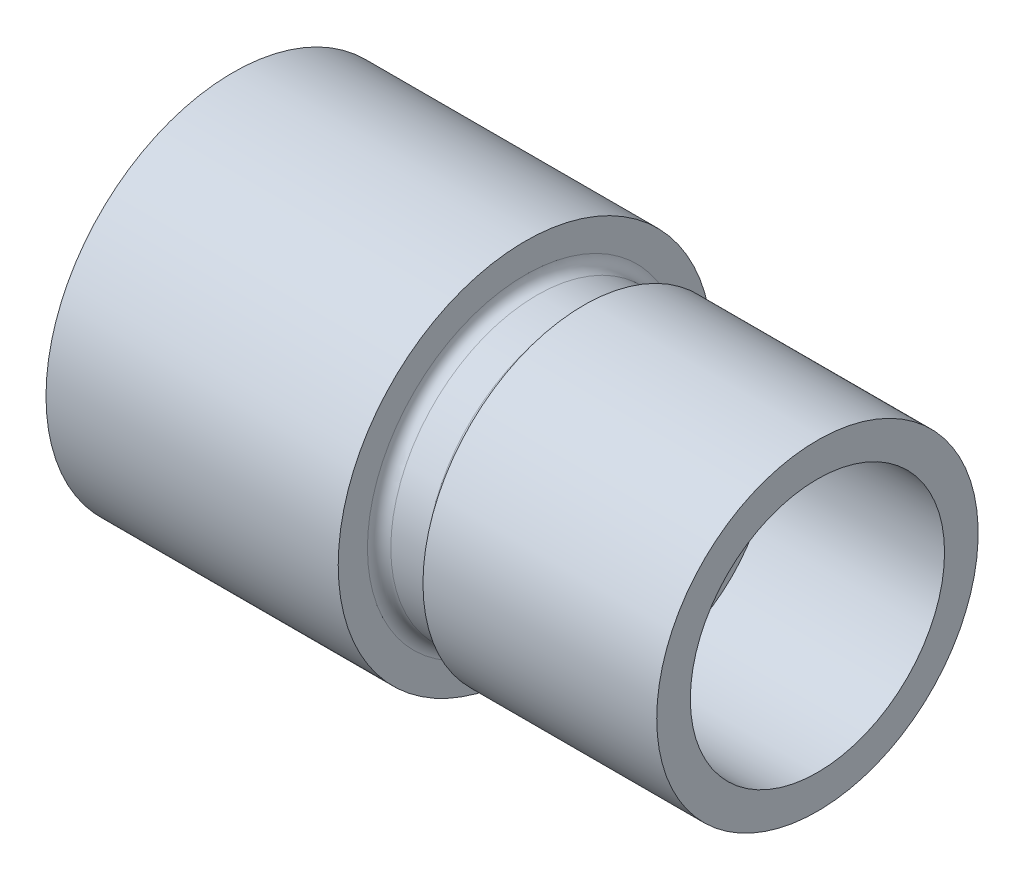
ISO-10303-21;
HEADER;
FILE_DESCRIPTION(('STEP AP214'),'2;1');
FILE_NAME('part.step','',(''),(''),'','','');
FILE_SCHEMA(('AUTOMOTIVE_DESIGN { 1 0 10303 214 1 1 1 1 }'));
ENDSEC;
DATA;
#1=APPLICATION_CONTEXT('core data for automotive mechanical design processes');
#2=APPLICATION_PROTOCOL_DEFINITION('international standard','automotive_design',2000,#1);
#3=PRODUCT_CONTEXT('',#1,'mechanical');
#4=PRODUCT('Part','Part','',(#3));
#5=PRODUCT_RELATED_PRODUCT_CATEGORY('part','',(#4));
#6=PRODUCT_DEFINITION_FORMATION('','',#4);
#7=PRODUCT_DEFINITION_CONTEXT('part definition',#1,'design');
#8=PRODUCT_DEFINITION('design','',#6,#7);
#9=PRODUCT_DEFINITION_SHAPE('','',#8);
#10=(LENGTH_UNIT() NAMED_UNIT(*) SI_UNIT(.MILLI.,.METRE.));
#11=(NAMED_UNIT(*) PLANE_ANGLE_UNIT() SI_UNIT($,.RADIAN.));
#12=(NAMED_UNIT(*) SI_UNIT($,.STERADIAN.) SOLID_ANGLE_UNIT());
#13=UNCERTAINTY_MEASURE_WITH_UNIT(LENGTH_MEASURE(1.E-05),#10,'distance_accuracy_value','');
#14=(GEOMETRIC_REPRESENTATION_CONTEXT(3) GLOBAL_UNCERTAINTY_ASSIGNED_CONTEXT((#13)) GLOBAL_UNIT_ASSIGNED_CONTEXT((#10,
#11,#12)) REPRESENTATION_CONTEXT('',''));
#15=CARTESIAN_POINT('',(0.,0.,0.));
#16=DIRECTION('',(0.,0.,1.));
#17=DIRECTION('',(1.,0.,0.));
#18=AXIS2_PLACEMENT_3D('',#15,#16,#17);
#19=CARTESIAN_POINT('',(0.,0.,0.));
#20=DIRECTION('',(-1.,0.,0.));
#21=DIRECTION('',(0.,0.,1.));
#22=AXIS2_PLACEMENT_3D('',#19,#20,#21);
#23=CYLINDRICAL_SURFACE('',#22,6.4);
#24=CARTESIAN_POINT('',(0.,0.,0.));
#25=DIRECTION('',(-1.,0.,0.));
#26=DIRECTION('',(0.,0.,1.));
#27=AXIS2_PLACEMENT_3D('',#24,#25,#26);
#28=CIRCLE('',#27,6.4);
#29=CARTESIAN_POINT('',(0.,0.,6.4));
#30=VERTEX_POINT('',#29);
#31=EDGE_CURVE('E12',#30,#30,#28,.T.);
#32=ORIENTED_EDGE('',*,*,#31,.F.);
#33=EDGE_LOOP('',(#32));
#34=FACE_BOUND('',#33,.T.);
#35=CARTESIAN_POINT('',(10.,0.,0.));
#36=DIRECTION('',(-1.,0.,0.));
#37=DIRECTION('',(0.,0.,1.));
#38=AXIS2_PLACEMENT_3D('',#35,#36,#37);
#39=CIRCLE('',#38,6.4);
#40=CARTESIAN_POINT('',(10.,0.,6.4));
#41=VERTEX_POINT('',#40);
#42=EDGE_CURVE('E89',#41,#41,#39,.T.);
#43=ORIENTED_EDGE('',*,*,#42,.T.);
#44=EDGE_LOOP('',(#43));
#45=FACE_BOUND('',#44,.T.);
#46=ADVANCED_FACE('F43',(#34,#45),#23,.T.);
#47=CARTESIAN_POINT('',(0.,6.4,0.));
#48=DIRECTION('',(1.,0.,0.));
#49=DIRECTION('',(0.,0.,-1.));
#50=AXIS2_PLACEMENT_3D('',#47,#48,#49);
#51=PLANE('',#50);
#52=CARTESIAN_POINT('',(0.,0.,0.));
#53=DIRECTION('',(-1.,0.,0.));
#54=DIRECTION('',(0.,0.,1.));
#55=AXIS2_PLACEMENT_3D('',#52,#53,#54);
#56=CIRCLE('',#55,4.325);
#57=CARTESIAN_POINT('',(0.,0.,4.325));
#58=VERTEX_POINT('',#57);
#59=EDGE_CURVE('E49',#58,#58,#56,.T.);
#60=ORIENTED_EDGE('',*,*,#59,.F.);
#61=EDGE_LOOP('',(#60));
#62=FACE_BOUND('',#61,.T.);
#63=ORIENTED_EDGE('',*,*,#31,.T.);
#64=EDGE_LOOP('',(#63));
#65=FACE_BOUND('',#64,.T.);
#66=ADVANCED_FACE('F162',(#62,#65),#51,.F.);
#67=CARTESIAN_POINT('',(0.,0.,0.));
#68=DIRECTION('',(-1.,0.,0.));
#69=DIRECTION('',(0.,0.,1.));
#70=AXIS2_PLACEMENT_3D('',#67,#68,#69);
#71=CYLINDRICAL_SURFACE('',#70,4.325);
#72=CARTESIAN_POINT('',(12.,0.,0.));
#73=DIRECTION('',(-1.,0.,0.));
#74=DIRECTION('',(0.,0.,1.));
#75=AXIS2_PLACEMENT_3D('',#72,#73,#74);
#76=CIRCLE('',#75,4.325);
#77=CARTESIAN_POINT('',(12.,0.,4.325));
#78=VERTEX_POINT('',#77);
#79=EDGE_CURVE('E53',#78,#78,#76,.T.);
#80=ORIENTED_EDGE('',*,*,#79,.F.);
#81=EDGE_LOOP('',(#80));
#82=FACE_BOUND('',#81,.T.);
#83=ORIENTED_EDGE('',*,*,#59,.T.);
#84=EDGE_LOOP('',(#83));
#85=FACE_BOUND('',#84,.T.);
#86=ADVANCED_FACE('F157',(#82,#85),#71,.F.);
#87=CARTESIAN_POINT('',(12.,2.65,0.));
#88=DIRECTION('',(1.,0.,0.));
#89=DIRECTION('',(0.,0.,-1.));
#90=AXIS2_PLACEMENT_3D('',#87,#88,#89);
#91=PLANE('',#90);
#92=CARTESIAN_POINT('',(12.,0.,0.));
#93=DIRECTION('',(-1.,0.,0.));
#94=DIRECTION('',(0.,0.,1.));
#95=AXIS2_PLACEMENT_3D('',#92,#93,#94);
#96=CIRCLE('',#95,2.65);
#97=CARTESIAN_POINT('',(12.,0.,2.65));
#98=VERTEX_POINT('',#97);
#99=EDGE_CURVE('E57',#98,#98,#96,.T.);
#100=ORIENTED_EDGE('',*,*,#99,.F.);
#101=EDGE_LOOP('',(#100));
#102=FACE_BOUND('',#101,.T.);
#103=ORIENTED_EDGE('',*,*,#79,.T.);
#104=EDGE_LOOP('',(#103));
#105=FACE_BOUND('',#104,.T.);
#106=ADVANCED_FACE('F151',(#102,#105),#91,.F.);
#107=CARTESIAN_POINT('',(0.,0.,0.));
#108=DIRECTION('',(-1.,0.,0.));
#109=DIRECTION('',(0.,0.,1.));
#110=AXIS2_PLACEMENT_3D('',#107,#108,#109);
#111=CYLINDRICAL_SURFACE('',#110,2.65);
#112=CARTESIAN_POINT('',(14.,0.,0.));
#113=DIRECTION('',(-1.,0.,0.));
#114=DIRECTION('',(0.,0.,1.));
#115=AXIS2_PLACEMENT_3D('',#112,#113,#114);
#116=CIRCLE('',#115,2.65);
#117=CARTESIAN_POINT('',(14.,0.,2.65));
#118=VERTEX_POINT('',#117);
#119=EDGE_CURVE('E62',#118,#118,#116,.T.);
#120=ORIENTED_EDGE('',*,*,#119,.F.);
#121=EDGE_LOOP('',(#120));
#122=FACE_BOUND('',#121,.T.);
#123=ORIENTED_EDGE('',*,*,#99,.T.);
#124=EDGE_LOOP('',(#123));
#125=FACE_BOUND('',#124,.T.);
#126=ADVANCED_FACE('F145',(#122,#125),#111,.F.);
#127=CARTESIAN_POINT('',(14.,4.35,0.));
#128=DIRECTION('',(-1.,0.,0.));
#129=DIRECTION('',(0.,0.,1.));
#130=AXIS2_PLACEMENT_3D('',#127,#128,#129);
#131=PLANE('',#130);
#132=CARTESIAN_POINT('',(14.,0.,0.));
#133=DIRECTION('',(-1.,0.,0.));
#134=DIRECTION('',(0.,0.,1.));
#135=AXIS2_PLACEMENT_3D('',#132,#133,#134);
#136=CIRCLE('',#135,4.35);
#137=CARTESIAN_POINT('',(14.,0.,4.35));
#138=VERTEX_POINT('',#137);
#139=EDGE_CURVE('E65',#138,#138,#136,.T.);
#140=ORIENTED_EDGE('',*,*,#139,.F.);
#141=EDGE_LOOP('',(#140));
#142=FACE_BOUND('',#141,.T.);
#143=ORIENTED_EDGE('',*,*,#119,.T.);
#144=EDGE_LOOP('',(#143));
#145=FACE_BOUND('',#144,.T.);
#146=ADVANCED_FACE('F139',(#142,#145),#131,.F.);
#147=CARTESIAN_POINT('',(0.,0.,0.));
#148=DIRECTION('',(-1.,0.,0.));
#149=DIRECTION('',(0.,0.,1.));
#150=AXIS2_PLACEMENT_3D('',#147,#148,#149);
#151=CYLINDRICAL_SURFACE('',#150,4.35);
#152=CARTESIAN_POINT('',(20.,0.,0.));
#153=DIRECTION('',(-1.,0.,0.));
#154=DIRECTION('',(0.,0.,1.));
#155=AXIS2_PLACEMENT_3D('',#152,#153,#154);
#156=CIRCLE('',#155,4.35);
#157=CARTESIAN_POINT('',(20.,0.,4.35));
#158=VERTEX_POINT('',#157);
#159=EDGE_CURVE('E68',#158,#158,#156,.T.);
#160=ORIENTED_EDGE('',*,*,#159,.F.);
#161=EDGE_LOOP('',(#160));
#162=FACE_BOUND('',#161,.T.);
#163=ORIENTED_EDGE('',*,*,#139,.T.);
#164=EDGE_LOOP('',(#163));
#165=FACE_BOUND('',#164,.T.);
#166=ADVANCED_FACE('F133',(#162,#165),#151,.F.);
#167=CARTESIAN_POINT('',(20.,5.5,0.));
#168=DIRECTION('',(-1.,0.,0.));
#169=DIRECTION('',(0.,0.,1.));
#170=AXIS2_PLACEMENT_3D('',#167,#168,#169);
#171=PLANE('',#170);
#172=CARTESIAN_POINT('',(20.,0.,0.));
#173=DIRECTION('',(-1.,0.,0.));
#174=DIRECTION('',(0.,0.,1.));
#175=AXIS2_PLACEMENT_3D('',#172,#173,#174);
#176=CIRCLE('',#175,5.5);
#177=CARTESIAN_POINT('',(20.,0.,5.5));
#178=VERTEX_POINT('',#177);
#179=EDGE_CURVE('E71',#178,#178,#176,.T.);
#180=ORIENTED_EDGE('',*,*,#179,.F.);
#181=EDGE_LOOP('',(#180));
#182=FACE_BOUND('',#181,.T.);
#183=ORIENTED_EDGE('',*,*,#159,.T.);
#184=EDGE_LOOP('',(#183));
#185=FACE_BOUND('',#184,.T.);
#186=ADVANCED_FACE('F127',(#182,#185),#171,.F.);
#187=CARTESIAN_POINT('',(0.,0.,0.));
#188=DIRECTION('',(-1.,0.,0.));
#189=DIRECTION('',(0.,0.,1.));
#190=AXIS2_PLACEMENT_3D('',#187,#188,#189);
#191=CYLINDRICAL_SURFACE('',#190,5.5);
#192=CARTESIAN_POINT('',(12.,0.,0.));
#193=DIRECTION('',(-1.,0.,0.));
#194=DIRECTION('',(0.,0.,1.));
#195=AXIS2_PLACEMENT_3D('',#192,#193,#194);
#196=CIRCLE('',#195,5.5);
#197=CARTESIAN_POINT('',(12.,0.,5.5));
#198=VERTEX_POINT('',#197);
#199=EDGE_CURVE('E74',#198,#198,#196,.T.);
#200=ORIENTED_EDGE('',*,*,#199,.F.);
#201=EDGE_LOOP('',(#200));
#202=FACE_BOUND('',#201,.T.);
#203=ORIENTED_EDGE('',*,*,#179,.T.);
#204=EDGE_LOOP('',(#203));
#205=FACE_BOUND('',#204,.T.);
#206=ADVANCED_FACE('F121',(#202,#205),#191,.T.);
#207=CARTESIAN_POINT('',(12.,5.5,0.));
#208=DIRECTION('',(1.,0.,0.));
#209=DIRECTION('',(0.,0.,-1.));
#210=AXIS2_PLACEMENT_3D('',#207,#208,#209);
#211=PLANE('',#210);
#212=CARTESIAN_POINT('',(12.,0.,0.));
#213=DIRECTION('',(-1.,0.,0.));
#214=DIRECTION('',(0.,0.,1.));
#215=AXIS2_PLACEMENT_3D('',#212,#213,#214);
#216=CIRCLE('',#215,5.4);
#217=CARTESIAN_POINT('',(12.,0.,5.4));
#218=VERTEX_POINT('',#217);
#219=EDGE_CURVE('E77',#218,#218,#216,.T.);
#220=ORIENTED_EDGE('',*,*,#219,.F.);
#221=EDGE_LOOP('',(#220));
#222=FACE_BOUND('',#221,.T.);
#223=ORIENTED_EDGE('',*,*,#199,.T.);
#224=EDGE_LOOP('',(#223));
#225=FACE_BOUND('',#224,.T.);
#226=ADVANCED_FACE('F115',(#222,#225),#211,.F.);
#227=CARTESIAN_POINT('',(11.6,0.,0.));
#228=DIRECTION('',(-1.,0.,0.));
#229=DIRECTION('',(0.,0.,1.));
#230=AXIS2_PLACEMENT_3D('',#227,#228,#229);
#231=TOROIDAL_SURFACE('',#230,5.4,0.4);
#232=CARTESIAN_POINT('',(11.6,0.,0.));
#233=DIRECTION('',(-1.,0.,0.));
#234=DIRECTION('',(0.,0.,1.));
#235=AXIS2_PLACEMENT_3D('',#232,#233,#234);
#236=CIRCLE('',#235,5.);
#237=CARTESIAN_POINT('',(11.6,0.,5.));
#238=VERTEX_POINT('',#237);
#239=EDGE_CURVE('E80',#238,#238,#236,.T.);
#240=ORIENTED_EDGE('',*,*,#239,.F.);
#241=EDGE_LOOP('',(#240));
#242=FACE_BOUND('',#241,.T.);
#243=ORIENTED_EDGE('',*,*,#219,.T.);
#244=EDGE_LOOP('',(#243));
#245=FACE_BOUND('',#244,.T.);
#246=ADVANCED_FACE('F109',(#242,#245),#231,.F.);
#247=CARTESIAN_POINT('',(0.,0.,0.));
#248=DIRECTION('',(-1.,0.,0.));
#249=DIRECTION('',(0.,0.,1.));
#250=AXIS2_PLACEMENT_3D('',#247,#248,#249);
#251=CYLINDRICAL_SURFACE('',#250,5.);
#252=CARTESIAN_POINT('',(10.4,0.,0.));
#253=DIRECTION('',(-1.,0.,0.));
#254=DIRECTION('',(0.,0.,1.));
#255=AXIS2_PLACEMENT_3D('',#252,#253,#254);
#256=CIRCLE('',#255,5.);
#257=CARTESIAN_POINT('',(10.4,0.,5.));
#258=VERTEX_POINT('',#257);
#259=EDGE_CURVE('E83',#258,#258,#256,.T.);
#260=ORIENTED_EDGE('',*,*,#259,.F.);
#261=EDGE_LOOP('',(#260));
#262=FACE_BOUND('',#261,.T.);
#263=ORIENTED_EDGE('',*,*,#239,.T.);
#264=EDGE_LOOP('',(#263));
#265=FACE_BOUND('',#264,.T.);
#266=ADVANCED_FACE('F103',(#262,#265),#251,.T.);
#267=CARTESIAN_POINT('',(10.4,0.,0.));
#268=DIRECTION('',(-1.,0.,0.));
#269=DIRECTION('',(0.,0.,1.));
#270=AXIS2_PLACEMENT_3D('',#267,#268,#269);
#271=TOROIDAL_SURFACE('',#270,5.4,0.400000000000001);
#272=CARTESIAN_POINT('',(10.,0.,0.));
#273=DIRECTION('',(-1.,0.,0.));
#274=DIRECTION('',(0.,0.,1.));
#275=AXIS2_PLACEMENT_3D('',#272,#273,#274);
#276=CIRCLE('',#275,5.4);
#277=CARTESIAN_POINT('',(10.,0.,5.4));
#278=VERTEX_POINT('',#277);
#279=EDGE_CURVE('E86',#278,#278,#276,.T.);
#280=ORIENTED_EDGE('',*,*,#279,.F.);
#281=EDGE_LOOP('',(#280));
#282=FACE_BOUND('',#281,.T.);
#283=ORIENTED_EDGE('',*,*,#259,.T.);
#284=EDGE_LOOP('',(#283));
#285=FACE_BOUND('',#284,.T.);
#286=ADVANCED_FACE('F97',(#282,#285),#271,.F.);
#287=CARTESIAN_POINT('',(10.,6.4,0.));
#288=DIRECTION('',(-1.,0.,0.));
#289=DIRECTION('',(0.,0.,1.));
#290=AXIS2_PLACEMENT_3D('',#287,#288,#289);
#291=PLANE('',#290);
#292=ORIENTED_EDGE('',*,*,#42,.F.);
#293=EDGE_LOOP('',(#292));
#294=FACE_BOUND('',#293,.T.);
#295=ORIENTED_EDGE('',*,*,#279,.T.);
#296=EDGE_LOOP('',(#295));
#297=FACE_BOUND('',#296,.T.);
#298=ADVANCED_FACE('F94',(#294,#297),#291,.F.);
#299=CLOSED_SHELL('',(#46,#66,#86,#106,#126,#146,#166,#186,#206,#226,#246,#266,#286,#298));
#300=MANIFOLD_SOLID_BREP('B2',#299);
#301=ADVANCED_BREP_SHAPE_REPRESENTATION('',(#18,#300),#14);
#302=SHAPE_DEFINITION_REPRESENTATION(#9,#301);
ENDSEC;
END-ISO-10303-21;
